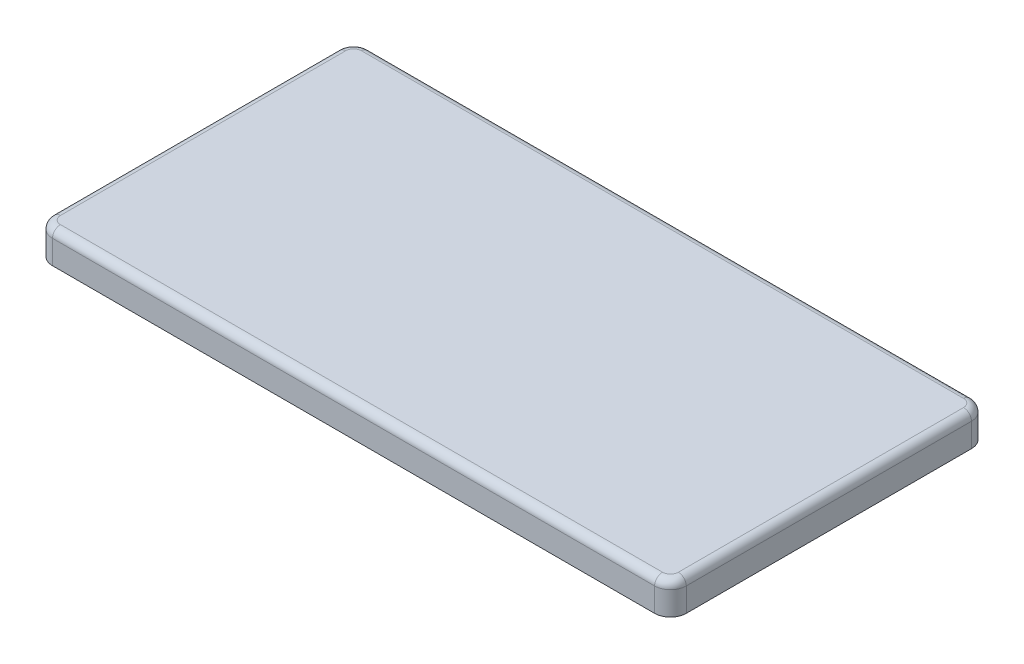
from build123d import *

# Parameters (mm, degrees)
EXTRUDE_1_DEPTH           = 2
FILLET_1_R                = 1
CUT_EXTRUDE_2_DEPTH       = 2
SKETCH_4_W                = 4.3
SKETCH_4_H                = 6.3
EXTRUDE_4_DEPTH           = 11
EXTRUDE_4_DRAFT           = 0.5
EXTRUDE_4_PROFILE_2_DEPTH = 11
EXTRUDE_4_PROFILE_2_DRAFT = 0.5
FILLET_2_R                = 0.8


with BuildPart() as part:
    # Sketch 1 → Extrude 1 (new, symmetric)
    with BuildSketch(Plane(origin=(0, 0, 0), x_dir=(0, 0, -1), z_dir=(0, 1, 0))):
        with BuildLine():
            Line((-18, 40), (18, 40))
            ThreePointArc((18, 40), (19.414213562, 39.414213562), (20, 38))
            Line((20, 38), (20, -38))
            ThreePointArc((20, -38), (19.414213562, -39.414213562), (18, -40))
            Line((18, -40), (-18, -40))
            ThreePointArc((-18, -40), (-19.414213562, -39.414213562), (-20, -38))
            Line((-20, -38), (-20, 38))
            ThreePointArc((-20, 38), (-19.414213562, 39.414213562), (-18, 40))
        make_face()
    extrude(amount=EXTRUDE_1_DEPTH, both=True)

    # Fillet 1
    fillet_1_edges = [part.edges().sort_by_distance(p)[0] for p in [
        (-39.414213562, 2, 19.414213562),
        (0, 2, 20),
        (39.414213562, 2, 19.414213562),
        (40, 2, 0),
        (39.414213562, 2, -19.414213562),
        (0, 2, -20),
        (-39.414213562, 2, -19.414213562),
        (-40, 2, 0),
    ]]
    fillet(fillet_1_edges, radius=FILLET_1_R)

    # Sketch 2 → Cut-Extrude 2 (cut)
    with BuildSketch(Plane.XZ.offset(2)):
        with BuildLine():
            Line((-37.2, 18), (37.2, 18))
            ThreePointArc((37.2, 18), (37.765685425, 17.765685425), (38, 17.2))
            Line((38, 17.2), (38, -17.2))
            ThreePointArc((38, -17.2), (37.765685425, -17.765685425), (37.2, -18))
            Line((37.2, -18), (-37.2, -18))
            ThreePointArc((-37.2, -18), (-37.765685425, -17.765685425), (-38, -17.2))
            Line((-38, -17.2), (-38, 17.2))
            ThreePointArc((-38, 17.2), (-37.765685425, 17.765685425), (-37.2, 18))
        make_face()
    extrude(amount=-CUT_EXTRUDE_2_DEPTH, mode=Mode.SUBTRACT)


with BuildPart() as extrude_4_tool:
    # Sketch 4 → Extrude 4 (with draft: the straight prism first)
    with BuildSketch(Plane.XZ):
        with Locations((-20, 0)):
            Rectangle(SKETCH_4_W, SKETCH_4_H)
    extrude(amount=EXTRUDE_4_DEPTH)
    # Extrude 4: the draft: its side faces are tilted about the plane it starts from
    extrude_4_sides = [extrude_4_tool.faces().sort_by_distance(p)[0] for p in [
        (-22.15, -5.5, 0),
        (-20, -5.5, -3.15),
        (-17.85, -5.5, 0),
        (-20, -5.5, 3.15),
    ]]
    draft(extrude_4_sides, Plane.XZ, EXTRUDE_4_DRAFT)


with BuildPart() as part_1:
    add(part.part)

    # Extrude 4: add extrude_4_tool
    add(extrude_4_tool.part)


with BuildPart() as extrude_4_profile_2_tool:
    # Sketch 4 → Extrude 4 profile 2 (with draft: the straight prism first)
    with BuildSketch(Plane.XZ):
        with Locations((20, 0)):
            Rectangle(SKETCH_4_W, SKETCH_4_H)
    extrude(amount=EXTRUDE_4_PROFILE_2_DEPTH)
    # Extrude 4 profile 2: the draft: its side faces are tilted about the plane it starts from
    extrude_4_profile_2_sides = [extrude_4_profile_2_tool.faces().sort_by_distance(p)[0] for p in [
        (17.85, -5.5, 0),
        (20, -5.5, -3.15),
        (22.15, -5.5, 0),
        (20, -5.5, 3.15),
    ]]
    draft(extrude_4_profile_2_sides, Plane.XZ, EXTRUDE_4_PROFILE_2_DRAFT)


with BuildPart() as part_2:
    add(part_1.part)

    # Extrude 4 profile 2: add extrude_4_profile_2_tool
    add(extrude_4_profile_2_tool.part)

    # Fillet 2
    fillet_2_edges = [part_2.edges().sort_by_distance(p)[0] for p in [
        (-22.054004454, -11, 0),
        (-20, -11, -3.054004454),
        (-17.945995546, -11, 0),
        (-20, -11, 3.054004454),
        (17.945995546, -11, 0),
        (20, -11, -3.054004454),
        (22.054004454, -11, 0),
        (20, -11, 3.054004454),
    ]]
    fillet(fillet_2_edges, radius=FILLET_2_R)


solid = part_2.part
